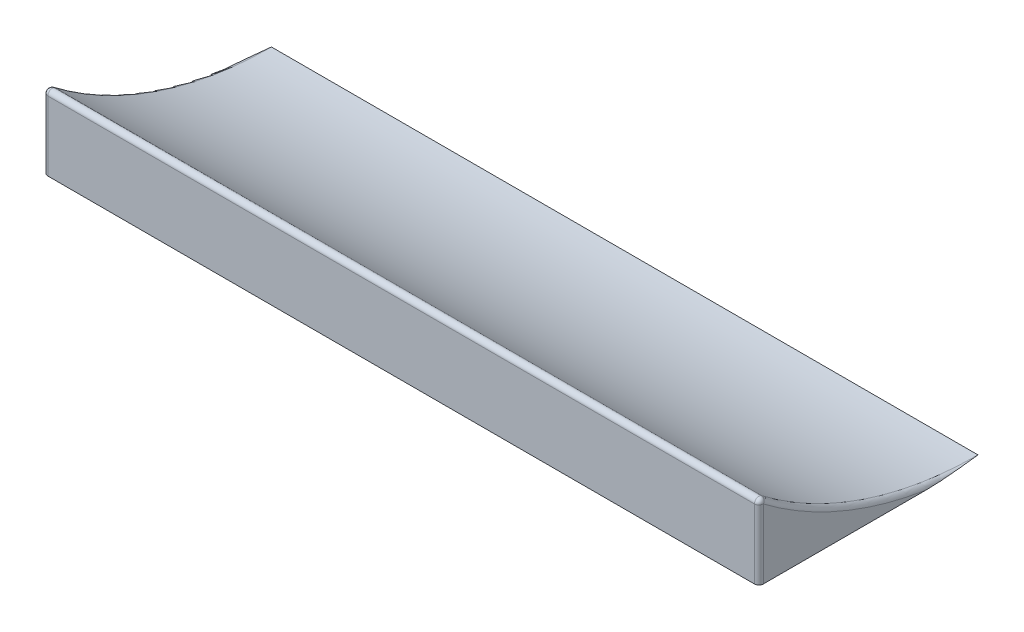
ISO-10303-21;
HEADER;
FILE_DESCRIPTION(('STEP AP214'),'2;1');
FILE_NAME('part.step','',(''),(''),'','','');
FILE_SCHEMA(('AUTOMOTIVE_DESIGN { 1 0 10303 214 1 1 1 1 }'));
ENDSEC;
DATA;
#1=APPLICATION_CONTEXT('core data for automotive mechanical design processes');
#2=APPLICATION_PROTOCOL_DEFINITION('international standard','automotive_design',2000,#1);
#3=PRODUCT_CONTEXT('',#1,'mechanical');
#4=PRODUCT('Part','Part','',(#3));
#5=PRODUCT_RELATED_PRODUCT_CATEGORY('part','',(#4));
#6=PRODUCT_DEFINITION_FORMATION('','',#4);
#7=PRODUCT_DEFINITION_CONTEXT('part definition',#1,'design');
#8=PRODUCT_DEFINITION('design','',#6,#7);
#9=PRODUCT_DEFINITION_SHAPE('','',#8);
#10=(LENGTH_UNIT() NAMED_UNIT(*) SI_UNIT(.MILLI.,.METRE.));
#11=(NAMED_UNIT(*) PLANE_ANGLE_UNIT() SI_UNIT($,.RADIAN.));
#12=(NAMED_UNIT(*) SI_UNIT($,.STERADIAN.) SOLID_ANGLE_UNIT());
#13=UNCERTAINTY_MEASURE_WITH_UNIT(LENGTH_MEASURE(1.E-05),#10,'distance_accuracy_value','');
#14=(GEOMETRIC_REPRESENTATION_CONTEXT(3) GLOBAL_UNCERTAINTY_ASSIGNED_CONTEXT((#13)) GLOBAL_UNIT_ASSIGNED_CONTEXT((#10,
#11,#12)) REPRESENTATION_CONTEXT('',''));
#15=CARTESIAN_POINT('',(0.,0.,0.));
#16=DIRECTION('',(0.,0.,1.));
#17=DIRECTION('',(1.,0.,0.));
#18=AXIS2_PLACEMENT_3D('',#15,#16,#17);
#19=CARTESIAN_POINT('',(800.,0.,0.));
#20=DIRECTION('',(0.,0.,-1.));
#21=DIRECTION('',(-1.,0.,0.));
#22=AXIS2_PLACEMENT_3D('',#19,#20,#21);
#23=PLANE('',#22);
#24=DIRECTION('',(-1.,0.,0.));
#25=VECTOR('',#24,1.);
#26=CARTESIAN_POINT('',(800.,0.,0.));
#27=LINE('',#26,#25);
#28=CARTESIAN_POINT('',(790.,0.,0.));
#29=VERTEX_POINT('',#28);
#30=CARTESIAN_POINT('',(-790.,0.,0.));
#31=VERTEX_POINT('',#30);
#32=EDGE_CURVE('E127',#29,#31,#27,.T.);
#33=ORIENTED_EDGE('',*,*,#32,.F.);
#34=DIRECTION('',(0.,-1.,0.));
#35=VECTOR('',#34,1.);
#36=CARTESIAN_POINT('',(790.,0.,0.));
#37=LINE('',#36,#35);
#38=CARTESIAN_POINT('',(790.,155.019380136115,0.));
#39=VERTEX_POINT('',#38);
#40=EDGE_CURVE('E103',#29,#39,#37,.F.);
#41=ORIENTED_EDGE('',*,*,#40,.T.);
#42=DIRECTION('',(-1.,0.,0.));
#43=VECTOR('',#42,1.);
#44=CARTESIAN_POINT('',(800.,155.019380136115,0.));
#45=LINE('',#44,#43);
#46=CARTESIAN_POINT('',(-790.,155.019380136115,0.));
#47=VERTEX_POINT('',#46);
#48=EDGE_CURVE('E108',#39,#47,#45,.T.);
#49=ORIENTED_EDGE('',*,*,#48,.T.);
#50=DIRECTION('',(0.,-1.,0.));
#51=VECTOR('',#50,1.);
#52=CARTESIAN_POINT('',(-790.,0.,0.));
#53=LINE('',#52,#51);
#54=EDGE_CURVE('E208',#47,#31,#53,.T.);
#55=ORIENTED_EDGE('',*,*,#54,.T.);
#56=EDGE_LOOP('',(#33,#41,#49,#55));
#57=FACE_BOUND('',#56,.T.);
#58=ADVANCED_FACE('F39',(#57),#23,.F.);
#59=CARTESIAN_POINT('',(800.,0.,0.));
#60=DIRECTION('',(0.,1.,0.));
#61=DIRECTION('',(0.,0.,1.));
#62=AXIS2_PLACEMENT_3D('',#59,#60,#61);
#63=PLANE('',#62);
#64=CARTESIAN_POINT('',(250.,0.,-250.));
#65=DIRECTION('',(0.,-1.,0.));
#66=DIRECTION('',(0.,0.,1.));
#67=AXIS2_PLACEMENT_3D('',#64,#65,#66);
#68=CIRCLE('',#67,5.00000000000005);
#69=CARTESIAN_POINT('',(250.,0.,-245.));
#70=VERTEX_POINT('',#69);
#71=EDGE_CURVE('E190',#70,#70,#68,.T.);
#72=ORIENTED_EDGE('',*,*,#71,.F.);
#73=EDGE_LOOP('',(#72));
#74=FACE_BOUND('',#73,.T.);
#75=CARTESIAN_POINT('',(-250.,0.,-250.));
#76=DIRECTION('',(0.,-1.,0.));
#77=DIRECTION('',(0.,0.,-1.));
#78=AXIS2_PLACEMENT_3D('',#75,#76,#77);
#79=CIRCLE('',#78,4.99999999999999);
#80=CARTESIAN_POINT('',(-250.,0.,-255.));
#81=VERTEX_POINT('',#80);
#82=EDGE_CURVE('E133',#81,#81,#79,.T.);
#83=ORIENTED_EDGE('',*,*,#82,.F.);
#84=EDGE_LOOP('',(#83));
#85=FACE_BOUND('',#84,.T.);
#86=DIRECTION('',(0.,0.,-1.));
#87=VECTOR('',#86,1.);
#88=CARTESIAN_POINT('',(800.,0.,0.));
#89=LINE('',#88,#87);
#90=CARTESIAN_POINT('',(800.,1.40500424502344E-13,-10.));
#91=VERTEX_POINT('',#90);
#92=CARTESIAN_POINT('',(800.,5.24227069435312E-12,-373.114224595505));
#93=VERTEX_POINT('',#92);
#94=EDGE_CURVE('E114',#91,#93,#89,.T.);
#95=ORIENTED_EDGE('',*,*,#94,.F.);
#96=CARTESIAN_POINT('',(790.,1.11022302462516E-13,-10.));
#97=DIRECTION('',(0.,1.,0.));
#98=DIRECTION('',(0.,0.,1.));
#99=AXIS2_PLACEMENT_3D('',#96,#97,#98);
#100=CIRCLE('',#99,10.);
#101=EDGE_CURVE('E98',#91,#29,#100,.F.);
#102=ORIENTED_EDGE('',*,*,#101,.T.);
#103=ORIENTED_EDGE('',*,*,#32,.T.);
#104=CARTESIAN_POINT('',(-790.,1.40500424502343E-13,-10.));
#105=DIRECTION('',(0.,1.,0.));
#106=DIRECTION('',(0.,0.,1.));
#107=AXIS2_PLACEMENT_3D('',#104,#105,#106);
#108=CIRCLE('',#107,10.);
#109=CARTESIAN_POINT('',(-800.,1.40500424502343E-13,-10.));
#110=VERTEX_POINT('',#109);
#111=EDGE_CURVE('E109',#31,#110,#108,.F.);
#112=ORIENTED_EDGE('',*,*,#111,.T.);
#113=DIRECTION('',(0.,0.,-1.));
#114=VECTOR('',#113,1.);
#115=CARTESIAN_POINT('',(-800.,0.,0.));
#116=LINE('',#115,#114);
#117=CARTESIAN_POINT('',(-800.,5.24227069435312E-12,-373.114224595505));
#118=VERTEX_POINT('',#117);
#119=EDGE_CURVE('E125',#110,#118,#116,.T.);
#120=ORIENTED_EDGE('',*,*,#119,.T.);
#121=CARTESIAN_POINT('',(-800.,5.24227069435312E-12,-373.114224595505));
#122=CARTESIAN_POINT('',(-799.999996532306,5.25398466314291E-12,-373.947956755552));
#123=CARTESIAN_POINT('',(-799.997441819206,5.26569859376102E-12,-374.781685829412));
#124=CARTESIAN_POINT('',(-799.987495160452,5.28912600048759E-12,-376.449111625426));
#125=CARTESIAN_POINT('',(-799.98010323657,5.30083947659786E-12,-377.282808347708));
#126=CARTESIAN_POINT('',(-799.951070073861,5.33597811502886E-12,-379.783772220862));
#127=CARTESIAN_POINT('',(-799.922571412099,5.35940218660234E-12,-381.450962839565));
#128=CARTESIAN_POINT('',(-799.849121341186,5.40623775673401E-12,-384.784440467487));
#129=CARTESIAN_POINT('',(-799.804175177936,5.42964925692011E-12,-386.450727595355));
#130=CARTESIAN_POINT('',(-799.699383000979,5.47646535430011E-12,-389.782842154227));
#131=CARTESIAN_POINT('',(-799.639536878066,5.49986995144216E-12,-391.448669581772));
#132=CARTESIAN_POINT('',(-799.506259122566,5.54668860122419E-12,-394.780880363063));
#133=CARTESIAN_POINT('',(-799.432818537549,5.57010264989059E-12,-396.447263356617));
#134=CARTESIAN_POINT('',(-799.273571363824,5.61691634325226E-12,-399.779440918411));
#135=CARTESIAN_POINT('',(-799.187764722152,5.64031598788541E-12,-401.445235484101));
#136=CARTESIAN_POINT('',(-798.91342583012,5.7105370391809E-12,-406.44175443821));
#137=CARTESIAN_POINT('',(-798.707976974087,5.75737976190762E-12,-409.771556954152));
#138=CARTESIAN_POINT('',(-798.259334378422,5.85077151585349E-12,-416.428885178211));
#139=CARTESIAN_POINT('',(-798.016137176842,5.89732051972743E-12,-419.756410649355));
#140=CARTESIAN_POINT('',(-797.498160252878,5.99133885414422E-12,-426.408960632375));
#141=CARTESIAN_POINT('',(-797.223380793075,6.03880817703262E-12,-429.733985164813));
#142=CARTESIAN_POINT('',(-796.647452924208,6.13017442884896E-12,-436.383189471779));
#143=CARTESIAN_POINT('',(-796.346293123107,6.17406979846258E-12,-439.707368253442));
#144=CARTESIAN_POINT('',(-795.722424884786,6.27512582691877E-12,-446.353699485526));
#145=CARTESIAN_POINT('',(-795.39971640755,6.33228651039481E-12,-449.675851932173));
#146=CARTESIAN_POINT('',(-794.405821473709,6.42931123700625E-12,-459.639424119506));
#147=CARTESIAN_POINT('',(-793.708838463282,6.39472994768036E-12,-466.278261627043));
#148=CARTESIAN_POINT('',(-792.508907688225,6.81328932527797E-12,-477.401051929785));
#149=CARTESIAN_POINT('',(-792.016274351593,7.11201054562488E-12,-481.886140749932));
#150=CARTESIAN_POINT('',(-791.022401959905,6.55507773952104E-12,-490.854896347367));
#151=CARTESIAN_POINT('',(-790.521163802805,5.69954345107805E-12,-495.338563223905));
#152=CARTESIAN_POINT('',(-790.013250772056,7.04000889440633E-12,-499.881481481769));
#153=CARTESIAN_POINT('',(-790.006625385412,7.0578748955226E-12,-499.94074074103));
#154=CARTESIAN_POINT('',(-790.,7.07612780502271E-12,-500.));
#155=B_SPLINE_CURVE_WITH_KNOTS('',3,(#121,#122,#123,#124,#125,#126,#127,#128,#129,#130,#131,
#132,#133,#134,#135,#136,#137,#138,#139,#140,#141,#142,#143,#144,#145,#146,#147,#148,#149,#150,
#151,#152,#153,#154),.UNSPECIFIED.,.F.,.F.,(4,2,2,2,2,2,2,2,2,2,2,2,2,2,2,2,4),(0.,
2.50118734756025,5.00236343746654,10.0045663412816,15.0051751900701,20.0058206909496,
25.0097710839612,30.0137429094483,40.0218580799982,50.0308916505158,60.0398420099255,
70.0531361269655,80.0664488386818,100.092161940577,113.628350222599,127.163134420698,
127.342019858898),.UNSPECIFIED.);
#156=CARTESIAN_POINT('',(-790.,7.02502122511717E-12,-500.));
#157=VERTEX_POINT('',#156);
#158=EDGE_CURVE('E118',#118,#157,#155,.T.);
#159=ORIENTED_EDGE('',*,*,#158,.T.);
#160=DIRECTION('',(-1.,0.,0.));
#161=VECTOR('',#160,1.);
#162=CARTESIAN_POINT('',(800.,7.02502122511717E-12,-500.));
#163=LINE('',#162,#161);
#164=CARTESIAN_POINT('',(790.,7.02502122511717E-12,-500.));
#165=VERTEX_POINT('',#164);
#166=EDGE_CURVE('E124',#165,#157,#163,.T.);
#167=ORIENTED_EDGE('',*,*,#166,.F.);
#168=CARTESIAN_POINT('',(800.,5.24227069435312E-12,-373.114224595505));
#169=CARTESIAN_POINT('',(799.999996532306,5.25398466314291E-12,-373.947956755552));
#170=CARTESIAN_POINT('',(799.997441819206,5.26569859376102E-12,-374.781685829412));
#171=CARTESIAN_POINT('',(799.987495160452,5.28912600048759E-12,-376.449111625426));
#172=CARTESIAN_POINT('',(799.98010323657,5.30083947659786E-12,-377.282808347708));
#173=CARTESIAN_POINT('',(799.951070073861,5.33597811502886E-12,-379.783772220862));
#174=CARTESIAN_POINT('',(799.922571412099,5.35940218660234E-12,-381.450962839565));
#175=CARTESIAN_POINT('',(799.849121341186,5.40623775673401E-12,-384.784440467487));
#176=CARTESIAN_POINT('',(799.804175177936,5.42964925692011E-12,-386.450727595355));
#177=CARTESIAN_POINT('',(799.699383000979,5.47646535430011E-12,-389.782842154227));
#178=CARTESIAN_POINT('',(799.639536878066,5.49986995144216E-12,-391.448669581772));
#179=CARTESIAN_POINT('',(799.506259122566,5.54668860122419E-12,-394.780880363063));
#180=CARTESIAN_POINT('',(799.432818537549,5.57010264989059E-12,-396.447263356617));
#181=CARTESIAN_POINT('',(799.273571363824,5.61691634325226E-12,-399.779440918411));
#182=CARTESIAN_POINT('',(799.187764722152,5.64031598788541E-12,-401.445235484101));
#183=CARTESIAN_POINT('',(798.91342583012,5.7105370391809E-12,-406.44175443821));
#184=CARTESIAN_POINT('',(798.707976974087,5.75737976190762E-12,-409.771556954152));
#185=CARTESIAN_POINT('',(798.259334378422,5.85077151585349E-12,-416.428885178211));
#186=CARTESIAN_POINT('',(798.016137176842,5.89732051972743E-12,-419.756410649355));
#187=CARTESIAN_POINT('',(797.498160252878,5.99133885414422E-12,-426.408960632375));
#188=CARTESIAN_POINT('',(797.223380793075,6.03880817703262E-12,-429.733985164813));
#189=CARTESIAN_POINT('',(796.647452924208,6.13017442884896E-12,-436.383189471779));
#190=CARTESIAN_POINT('',(796.346293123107,6.17406979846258E-12,-439.707368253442));
#191=CARTESIAN_POINT('',(795.722424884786,6.27512582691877E-12,-446.353699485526));
#192=CARTESIAN_POINT('',(795.39971640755,6.33228651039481E-12,-449.675851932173));
#193=CARTESIAN_POINT('',(794.405821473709,6.42931123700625E-12,-459.639424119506));
#194=CARTESIAN_POINT('',(793.708838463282,6.39472994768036E-12,-466.278261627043));
#195=CARTESIAN_POINT('',(792.508907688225,6.81328932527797E-12,-477.401051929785));
#196=CARTESIAN_POINT('',(792.016274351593,7.11201054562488E-12,-481.886140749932));
#197=CARTESIAN_POINT('',(791.022401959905,6.55507773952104E-12,-490.854896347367));
#198=CARTESIAN_POINT('',(790.521163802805,5.69954345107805E-12,-495.338563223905));
#199=CARTESIAN_POINT('',(790.013250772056,7.04000889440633E-12,-499.881481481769));
#200=CARTESIAN_POINT('',(790.006625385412,7.0578748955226E-12,-499.94074074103));
#201=CARTESIAN_POINT('',(790.,7.07612780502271E-12,-500.));
#202=B_SPLINE_CURVE_WITH_KNOTS('',3,(#168,#169,#170,#171,#172,#173,#174,#175,#176,#177,#178,
#179,#180,#181,#182,#183,#184,#185,#186,#187,#188,#189,#190,#191,#192,#193,#194,#195,#196,#197,
#198,#199,#200,#201),.UNSPECIFIED.,.F.,.F.,(4,2,2,2,2,2,2,2,2,2,2,2,2,2,2,2,4),(0.,
2.50118734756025,5.00236343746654,10.0045663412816,15.0051751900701,20.0058206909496,
25.0097710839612,30.0137429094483,40.0218580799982,50.0308916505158,60.0398420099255,
70.0531361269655,80.0664488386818,100.092161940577,113.628350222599,127.163134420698,
127.342019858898),.UNSPECIFIED.);
#203=EDGE_CURVE('E123',#165,#93,#202,.F.);
#204=ORIENTED_EDGE('',*,*,#203,.T.);
#205=EDGE_LOOP('',(#95,#102,#103,#112,#120,#159,#167,#204));
#206=FACE_BOUND('',#205,.T.);
#207=ADVANCED_FACE('F120',(#74,#85,#206),#63,.F.);
#208=CARTESIAN_POINT('',(800.,800.000000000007,-499.999999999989));
#209=DIRECTION('',(-1.,0.,0.));
#210=DIRECTION('',(0.,0.,1.));
#211=AXIS2_PLACEMENT_3D('',#208,#209,#210);
#212=CYLINDRICAL_SURFACE('',#211,800.);
#213=DIRECTION('',(-1.,0.,0.));
#214=VECTOR('',#213,1.);
#215=CARTESIAN_POINT('',(800.,162.982103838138,-16.0493827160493));
#216=LINE('',#215,#214);
#217=CARTESIAN_POINT('',(-790.,162.982103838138,-16.0493827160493));
#218=VERTEX_POINT('',#217);
#219=CARTESIAN_POINT('',(790.,162.982103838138,-16.0493827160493));
#220=VERTEX_POINT('',#219);
#221=EDGE_CURVE('E48',#218,#220,#216,.F.);
#222=ORIENTED_EDGE('',*,*,#221,.T.);
#223=CARTESIAN_POINT('',(790.,800.000000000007,-499.999999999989));
#224=DIRECTION('',(-1.,0.,0.));
#225=DIRECTION('',(0.,0.,1.));
#226=AXIS2_PLACEMENT_3D('',#223,#224,#225);
#227=CIRCLE('',#226,800.);
#228=EDGE_CURVE('E11',#220,#165,#227,.F.);
#229=ORIENTED_EDGE('',*,*,#228,.T.);
#230=ORIENTED_EDGE('',*,*,#166,.T.);
#231=CARTESIAN_POINT('',(-790.,800.000000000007,-499.999999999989));
#232=DIRECTION('',(-1.,0.,0.));
#233=DIRECTION('',(0.,0.,1.));
#234=AXIS2_PLACEMENT_3D('',#231,#232,#233);
#235=CIRCLE('',#234,800.);
#236=EDGE_CURVE('E59',#157,#218,#235,.T.);
#237=ORIENTED_EDGE('',*,*,#236,.T.);
#238=EDGE_LOOP('',(#222,#229,#230,#237));
#239=FACE_BOUND('',#238,.T.);
#240=ADVANCED_FACE('F155',(#239),#212,.F.);
#241=CARTESIAN_POINT('',(800.,800.000000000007,-499.999999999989));
#242=DIRECTION('',(-1.,0.,0.));
#243=DIRECTION('',(0.,0.,1.));
#244=AXIS2_PLACEMENT_3D('',#241,#242,#243);
#245=PLANE('',#244);
#246=CARTESIAN_POINT('',(800.,800.000000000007,-499.999999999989));
#247=DIRECTION('',(-1.,0.,0.));
#248=DIRECTION('',(0.,0.,1.));
#249=AXIS2_PLACEMENT_3D('',#246,#247,#248);
#250=CIRCLE('',#249,810.);
#251=CARTESIAN_POINT('',(800.,155.019380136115,-10.));
#252=VERTEX_POINT('',#251);
#253=EDGE_CURVE('E116',#93,#252,#250,.T.);
#254=ORIENTED_EDGE('',*,*,#253,.T.);
#255=DIRECTION('',(0.,-1.,0.));
#256=VECTOR('',#255,1.);
#257=CARTESIAN_POINT('',(800.,800.000000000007,-10.));
#258=LINE('',#257,#256);
#259=EDGE_CURVE('E102',#252,#91,#258,.T.);
#260=ORIENTED_EDGE('',*,*,#259,.T.);
#261=ORIENTED_EDGE('',*,*,#94,.T.);
#262=EDGE_LOOP('',(#254,#260,#261));
#263=FACE_BOUND('',#262,.T.);
#264=ADVANCED_FACE('F113',(#263),#245,.F.);
#265=CARTESIAN_POINT('',(-800.,800.000000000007,-499.999999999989));
#266=DIRECTION('',(-1.,0.,0.));
#267=DIRECTION('',(0.,0.,1.));
#268=AXIS2_PLACEMENT_3D('',#265,#266,#267);
#269=PLANE('',#268);
#270=ORIENTED_EDGE('',*,*,#119,.F.);
#271=DIRECTION('',(0.,-1.,0.));
#272=VECTOR('',#271,1.);
#273=CARTESIAN_POINT('',(-800.,175.500200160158,-10.));
#274=LINE('',#273,#272);
#275=CARTESIAN_POINT('',(-800.,155.019380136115,-10.));
#276=VERTEX_POINT('',#275);
#277=EDGE_CURVE('E203',#110,#276,#274,.F.);
#278=ORIENTED_EDGE('',*,*,#277,.T.);
#279=CARTESIAN_POINT('',(-800.,800.000000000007,-499.999999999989));
#280=DIRECTION('',(-1.,0.,0.));
#281=DIRECTION('',(0.,0.,1.));
#282=AXIS2_PLACEMENT_3D('',#279,#280,#281);
#283=CIRCLE('',#282,810.);
#284=EDGE_CURVE('E205',#276,#118,#283,.F.);
#285=ORIENTED_EDGE('',*,*,#284,.T.);
#286=EDGE_LOOP('',(#270,#278,#285));
#287=FACE_BOUND('',#286,.T.);
#288=ADVANCED_FACE('F217',(#287),#269,.T.);
#289=CARTESIAN_POINT('',(-250.,10.,-250.));
#290=DIRECTION('',(0.,-1.,0.));
#291=DIRECTION('',(0.,0.,-1.));
#292=AXIS2_PLACEMENT_3D('',#289,#290,#291);
#293=CYLINDRICAL_SURFACE('',#292,4.99999999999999);
#294=CARTESIAN_POINT('',(-250.,10.,-250.));
#295=DIRECTION('',(0.,-1.,0.));
#296=DIRECTION('',(0.,0.,-1.));
#297=AXIS2_PLACEMENT_3D('',#294,#295,#296);
#298=CIRCLE('',#297,4.99999999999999);
#299=CARTESIAN_POINT('',(-250.,10.,-255.));
#300=VERTEX_POINT('',#299);
#301=EDGE_CURVE('E130',#300,#300,#298,.T.);
#302=ORIENTED_EDGE('',*,*,#301,.F.);
#303=EDGE_LOOP('',(#302));
#304=FACE_BOUND('',#303,.T.);
#305=ORIENTED_EDGE('',*,*,#82,.T.);
#306=EDGE_LOOP('',(#305));
#307=FACE_BOUND('',#306,.T.);
#308=ADVANCED_FACE('F231',(#304,#307),#293,.F.);
#309=CARTESIAN_POINT('',(-250.,10.,-250.));
#310=DIRECTION('',(0.,-1.,0.));
#311=DIRECTION('',(0.,0.,-1.));
#312=AXIS2_PLACEMENT_3D('',#309,#310,#311);
#313=PLANE('',#312);
#314=ORIENTED_EDGE('',*,*,#301,.T.);
#315=EDGE_LOOP('',(#314));
#316=FACE_BOUND('',#315,.T.);
#317=ADVANCED_FACE('F235',(#316),#313,.T.);
#318=CARTESIAN_POINT('',(250.,10.,-250.));
#319=DIRECTION('',(0.,-1.,0.));
#320=DIRECTION('',(0.,0.,-1.));
#321=AXIS2_PLACEMENT_3D('',#318,#319,#320);
#322=CYLINDRICAL_SURFACE('',#321,5.00000000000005);
#323=CARTESIAN_POINT('',(250.,10.,-250.));
#324=DIRECTION('',(0.,-1.,0.));
#325=DIRECTION('',(0.,0.,1.));
#326=AXIS2_PLACEMENT_3D('',#323,#324,#325);
#327=CIRCLE('',#326,5.00000000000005);
#328=CARTESIAN_POINT('',(250.,10.,-245.));
#329=VERTEX_POINT('',#328);
#330=EDGE_CURVE('E252',#329,#329,#327,.T.);
#331=ORIENTED_EDGE('',*,*,#330,.F.);
#332=EDGE_LOOP('',(#331));
#333=FACE_BOUND('',#332,.T.);
#334=ORIENTED_EDGE('',*,*,#71,.T.);
#335=EDGE_LOOP('',(#334));
#336=FACE_BOUND('',#335,.T.);
#337=ADVANCED_FACE('F239',(#333,#336),#322,.F.);
#338=CARTESIAN_POINT('',(250.,10.,-250.));
#339=DIRECTION('',(0.,1.,0.));
#340=DIRECTION('',(0.,0.,1.));
#341=AXIS2_PLACEMENT_3D('',#338,#339,#340);
#342=PLANE('',#341);
#343=ORIENTED_EDGE('',*,*,#330,.T.);
#344=EDGE_LOOP('',(#343));
#345=FACE_BOUND('',#344,.T.);
#346=ADVANCED_FACE('F243',(#345),#342,.F.);
#347=CARTESIAN_POINT('',(-790.,0.,-10.));
#348=DIRECTION('',(0.,1.,0.));
#349=DIRECTION('',(0.,0.,1.));
#350=AXIS2_PLACEMENT_3D('',#347,#348,#349);
#351=CYLINDRICAL_SURFACE('',#350,10.);
#352=ORIENTED_EDGE('',*,*,#111,.F.);
#353=ORIENTED_EDGE('',*,*,#54,.F.);
#354=CARTESIAN_POINT('',(-790.,155.019380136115,-10.));
#355=DIRECTION('',(0.,1.,0.));
#356=DIRECTION('',(0.,0.,1.));
#357=AXIS2_PLACEMENT_3D('',#354,#355,#356);
#358=CIRCLE('',#357,10.);
#359=EDGE_CURVE('E43',#276,#47,#358,.T.);
#360=ORIENTED_EDGE('',*,*,#359,.F.);
#361=ORIENTED_EDGE('',*,*,#277,.F.);
#362=EDGE_LOOP('',(#352,#353,#360,#361));
#363=FACE_BOUND('',#362,.T.);
#364=ADVANCED_FACE('F41',(#363),#351,.T.);
#365=CARTESIAN_POINT('',(-790.,800.000000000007,-499.999999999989));
#366=DIRECTION('',(-1.,0.,0.));
#367=DIRECTION('',(0.,0.,1.));
#368=AXIS2_PLACEMENT_3D('',#365,#366,#367);
#369=TOROIDAL_SURFACE('',#368,810.,10.);
#370=ORIENTED_EDGE('',*,*,#158,.F.);
#371=ORIENTED_EDGE('',*,*,#284,.F.);
#372=CARTESIAN_POINT('',(-790.,155.019380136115,-10.));
#373=DIRECTION('',(0.,0.604938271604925,0.796272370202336));
#374=DIRECTION('',(0.,-0.796272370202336,0.604938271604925));
#375=AXIS2_PLACEMENT_3D('',#372,#373,#374);
#376=CIRCLE('',#375,10.);
#377=EDGE_CURVE('E185',#218,#276,#376,.T.);
#378=ORIENTED_EDGE('',*,*,#377,.F.);
#379=ORIENTED_EDGE('',*,*,#236,.F.);
#380=EDGE_LOOP('',(#370,#371,#378,#379));
#381=FACE_BOUND('',#380,.T.);
#382=ADVANCED_FACE('F148',(#381),#369,.T.);
#383=CARTESIAN_POINT('',(-790.,155.019380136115,-10.));
#384=DIRECTION('',(0.,0.,1.));
#385=DIRECTION('',(1.,0.,0.));
#386=AXIS2_PLACEMENT_3D('',#383,#384,#385);
#387=SPHERICAL_SURFACE('',#386,10.);
#388=ORIENTED_EDGE('',*,*,#377,.T.);
#389=ORIENTED_EDGE('',*,*,#359,.T.);
#390=CARTESIAN_POINT('',(-790.,155.019380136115,-10.));
#391=DIRECTION('',(-1.,0.,0.));
#392=DIRECTION('',(0.,0.,1.));
#393=AXIS2_PLACEMENT_3D('',#390,#391,#392);
#394=CIRCLE('',#393,10.);
#395=EDGE_CURVE('E188',#218,#47,#394,.F.);
#396=ORIENTED_EDGE('',*,*,#395,.F.);
#397=EDGE_LOOP('',(#388,#389,#396));
#398=FACE_BOUND('',#397,.T.);
#399=ADVANCED_FACE('F174',(#398),#387,.T.);
#400=CARTESIAN_POINT('',(800.,155.019380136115,-10.));
#401=DIRECTION('',(-1.,0.,0.));
#402=DIRECTION('',(0.,0.,1.));
#403=AXIS2_PLACEMENT_3D('',#400,#401,#402);
#404=CYLINDRICAL_SURFACE('',#403,10.);
#405=ORIENTED_EDGE('',*,*,#395,.T.);
#406=ORIENTED_EDGE('',*,*,#48,.F.);
#407=CARTESIAN_POINT('',(790.,155.019380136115,-10.));
#408=DIRECTION('',(1.,0.,0.));
#409=DIRECTION('',(0.,0.,-1.));
#410=AXIS2_PLACEMENT_3D('',#407,#408,#409);
#411=CIRCLE('',#410,10.);
#412=EDGE_CURVE('E191',#220,#39,#411,.T.);
#413=ORIENTED_EDGE('',*,*,#412,.F.);
#414=ORIENTED_EDGE('',*,*,#221,.F.);
#415=EDGE_LOOP('',(#405,#406,#413,#414));
#416=FACE_BOUND('',#415,.T.);
#417=ADVANCED_FACE('F171',(#416),#404,.T.);
#418=CARTESIAN_POINT('',(790.,800.000000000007,-499.999999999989));
#419=DIRECTION('',(-1.,0.,0.));
#420=DIRECTION('',(0.,0.,1.));
#421=AXIS2_PLACEMENT_3D('',#418,#419,#420);
#422=TOROIDAL_SURFACE('',#421,810.,10.);
#423=ORIENTED_EDGE('',*,*,#203,.F.);
#424=ORIENTED_EDGE('',*,*,#228,.F.);
#425=CARTESIAN_POINT('',(790.,155.019380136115,-10.));
#426=DIRECTION('',(0.,0.604938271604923,0.796272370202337));
#427=DIRECTION('',(0.,-0.796272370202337,0.604938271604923));
#428=AXIS2_PLACEMENT_3D('',#425,#426,#427);
#429=CIRCLE('',#428,10.);
#430=EDGE_CURVE('E196',#252,#220,#429,.T.);
#431=ORIENTED_EDGE('',*,*,#430,.F.);
#432=ORIENTED_EDGE('',*,*,#253,.F.);
#433=EDGE_LOOP('',(#423,#424,#431,#432));
#434=FACE_BOUND('',#433,.T.);
#435=ADVANCED_FACE('F166',(#434),#422,.T.);
#436=CARTESIAN_POINT('',(790.,155.019380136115,-10.));
#437=DIRECTION('',(0.,0.,1.));
#438=DIRECTION('',(1.,0.,0.));
#439=AXIS2_PLACEMENT_3D('',#436,#437,#438);
#440=SPHERICAL_SURFACE('',#439,10.);
#441=ORIENTED_EDGE('',*,*,#430,.T.);
#442=ORIENTED_EDGE('',*,*,#412,.T.);
#443=CARTESIAN_POINT('',(790.,155.019380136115,-10.));
#444=DIRECTION('',(0.,1.,0.));
#445=DIRECTION('',(-1.,0.,0.));
#446=AXIS2_PLACEMENT_3D('',#443,#444,#445);
#447=CIRCLE('',#446,10.);
#448=EDGE_CURVE('E199',#252,#39,#447,.F.);
#449=ORIENTED_EDGE('',*,*,#448,.F.);
#450=EDGE_LOOP('',(#441,#442,#449));
#451=FACE_BOUND('',#450,.T.);
#452=ADVANCED_FACE('F164',(#451),#440,.T.);
#453=CARTESIAN_POINT('',(790.,800.000000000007,-10.));
#454=DIRECTION('',(0.,-1.,0.));
#455=DIRECTION('',(0.,0.,-1.));
#456=AXIS2_PLACEMENT_3D('',#453,#454,#455);
#457=CYLINDRICAL_SURFACE('',#456,10.);
#458=ORIENTED_EDGE('',*,*,#448,.T.);
#459=ORIENTED_EDGE('',*,*,#40,.F.);
#460=ORIENTED_EDGE('',*,*,#101,.F.);
#461=ORIENTED_EDGE('',*,*,#259,.F.);
#462=EDGE_LOOP('',(#458,#459,#460,#461));
#463=FACE_BOUND('',#462,.T.);
#464=ADVANCED_FACE('F101',(#463),#457,.T.);
#465=CLOSED_SHELL('',(#58,#207,#240,#264,#288,#308,#317,#337,#346,#364,#382,#399,#417,#435,#452,#464));
#466=MANIFOLD_SOLID_BREP('B2',#465);
#467=ADVANCED_BREP_SHAPE_REPRESENTATION('',(#18,#466),#14);
#468=SHAPE_DEFINITION_REPRESENTATION(#9,#467);
ENDSEC;
END-ISO-10303-21;
